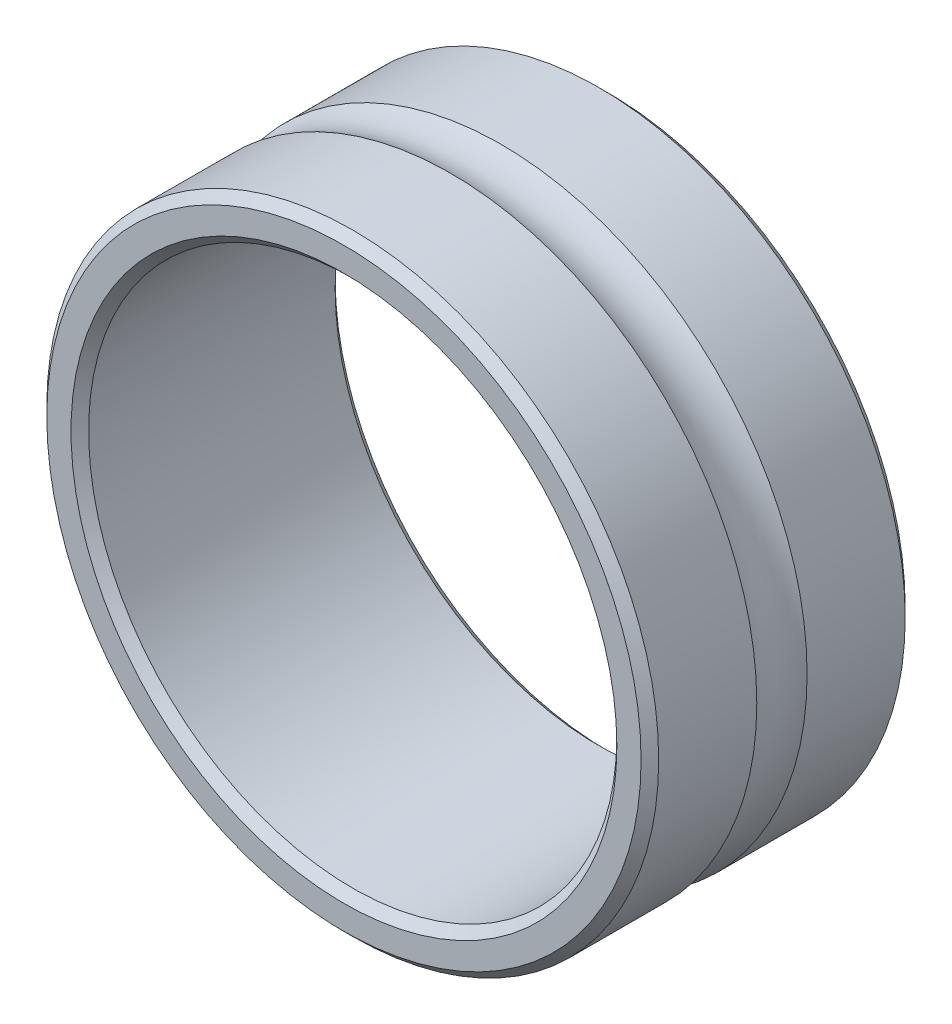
ISO-10303-21;
HEADER;
FILE_DESCRIPTION(('STEP AP214'),'2;1');
FILE_NAME('part.step','',(''),(''),'','','');
FILE_SCHEMA(('AUTOMOTIVE_DESIGN { 1 0 10303 214 1 1 1 1 }'));
ENDSEC;
DATA;
#1=APPLICATION_CONTEXT('core data for automotive mechanical design processes');
#2=APPLICATION_PROTOCOL_DEFINITION('international standard','automotive_design',2000,#1);
#3=PRODUCT_CONTEXT('',#1,'mechanical');
#4=PRODUCT('Part','Part','',(#3));
#5=PRODUCT_RELATED_PRODUCT_CATEGORY('part','',(#4));
#6=PRODUCT_DEFINITION_FORMATION('','',#4);
#7=PRODUCT_DEFINITION_CONTEXT('part definition',#1,'design');
#8=PRODUCT_DEFINITION('design','',#6,#7);
#9=PRODUCT_DEFINITION_SHAPE('','',#8);
#10=(LENGTH_UNIT() NAMED_UNIT(*) SI_UNIT(.MILLI.,.METRE.));
#11=(NAMED_UNIT(*) PLANE_ANGLE_UNIT() SI_UNIT($,.RADIAN.));
#12=(NAMED_UNIT(*) SI_UNIT($,.STERADIAN.) SOLID_ANGLE_UNIT());
#13=UNCERTAINTY_MEASURE_WITH_UNIT(LENGTH_MEASURE(1.E-05),#10,'distance_accuracy_value','');
#14=(GEOMETRIC_REPRESENTATION_CONTEXT(3) GLOBAL_UNCERTAINTY_ASSIGNED_CONTEXT((#13)) GLOBAL_UNIT_ASSIGNED_CONTEXT((#10,
#11,#12)) REPRESENTATION_CONTEXT('',''));
#15=CARTESIAN_POINT('',(0.,0.,0.));
#16=DIRECTION('',(0.,0.,1.));
#17=DIRECTION('',(1.,0.,0.));
#18=AXIS2_PLACEMENT_3D('',#15,#16,#17);
#19=CARTESIAN_POINT('',(0.,0.,0.));
#20=DIRECTION('',(0.,0.,1.));
#21=DIRECTION('',(1.,0.,0.));
#22=AXIS2_PLACEMENT_3D('',#19,#20,#21);
#23=TOROIDAL_SURFACE('',#22,3.9975,0.5955);
#24=CARTESIAN_POINT('',(0.,0.,0.285681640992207));
#25=DIRECTION('',(0.,0.,1.));
#26=DIRECTION('',(1.,0.,0.));
#27=AXIS2_PLACEMENT_3D('',#24,#25,#26);
#28=CIRCLE('',#27,3.475);
#29=CARTESIAN_POINT('',(3.475,0.,0.285681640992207));
#30=VERTEX_POINT('',#29);
#31=EDGE_CURVE('E42',#30,#30,#28,.T.);
#32=ORIENTED_EDGE('',*,*,#31,.F.);
#33=EDGE_LOOP('',(#32));
#34=FACE_BOUND('',#33,.T.);
#35=CARTESIAN_POINT('',(0.,0.,-0.285681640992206));
#36=DIRECTION('',(0.,0.,1.));
#37=DIRECTION('',(1.,0.,0.));
#38=AXIS2_PLACEMENT_3D('',#35,#36,#37);
#39=CIRCLE('',#38,3.475);
#40=CARTESIAN_POINT('',(3.475,0.,-0.285681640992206));
#41=VERTEX_POINT('',#40);
#42=EDGE_CURVE('E39',#41,#41,#39,.F.);
#43=ORIENTED_EDGE('',*,*,#42,.F.);
#44=EDGE_LOOP('',(#43));
#45=FACE_BOUND('',#44,.T.);
#46=ADVANCED_FACE('F15',(#34,#45),#23,.F.);
#47=CARTESIAN_POINT('',(0.,0.,0.));
#48=DIRECTION('',(0.,0.,1.));
#49=DIRECTION('',(1.,0.,0.));
#50=AXIS2_PLACEMENT_3D('',#47,#48,#49);
#51=CYLINDRICAL_SURFACE('',#50,3.475);
#52=ORIENTED_EDGE('',*,*,#31,.T.);
#53=EDGE_LOOP('',(#52));
#54=FACE_BOUND('',#53,.T.);
#55=CARTESIAN_POINT('',(0.,0.,1.40000000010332));
#56=DIRECTION('',(0.,0.,-1.));
#57=DIRECTION('',(-1.,0.,0.));
#58=AXIS2_PLACEMENT_3D('',#55,#56,#57);
#59=CIRCLE('',#58,3.4750000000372);
#60=CARTESIAN_POINT('',(-3.4750000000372,0.,1.40000000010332));
#61=VERTEX_POINT('',#60);
#62=EDGE_CURVE('E36',#61,#61,#59,.F.);
#63=ORIENTED_EDGE('',*,*,#62,.F.);
#64=EDGE_LOOP('',(#63));
#65=FACE_BOUND('',#64,.T.);
#66=ADVANCED_FACE('F112',(#54,#65),#51,.T.);
#67=CARTESIAN_POINT('',(0.,0.,0.));
#68=DIRECTION('',(0.,0.,1.));
#69=DIRECTION('',(1.,0.,0.));
#70=AXIS2_PLACEMENT_3D('',#67,#68,#69);
#71=CYLINDRICAL_SURFACE('',#70,3.475);
#72=CARTESIAN_POINT('',(0.,0.,-1.39999999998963));
#73=DIRECTION('',(0.,0.,1.));
#74=DIRECTION('',(1.,0.,0.));
#75=AXIS2_PLACEMENT_3D('',#72,#73,#74);
#76=CIRCLE('',#75,3.47499999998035);
#77=CARTESIAN_POINT('',(3.47499999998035,0.,-1.39999999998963));
#78=VERTEX_POINT('',#77);
#79=EDGE_CURVE('E33',#78,#78,#76,.F.);
#80=ORIENTED_EDGE('',*,*,#79,.F.);
#81=EDGE_LOOP('',(#80));
#82=FACE_BOUND('',#81,.T.);
#83=ORIENTED_EDGE('',*,*,#42,.T.);
#84=EDGE_LOOP('',(#83));
#85=FACE_BOUND('',#84,.T.);
#86=ADVANCED_FACE('F105',(#82,#85),#71,.T.);
#87=CARTESIAN_POINT('',(0.,0.,1.40000000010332));
#88=DIRECTION('',(0.,0.,-1.));
#89=DIRECTION('',(-1.,0.,0.));
#90=AXIS2_PLACEMENT_3D('',#87,#88,#89);
#91=CONICAL_SURFACE('',#90,3.4750000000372,0.785398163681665);
#92=CARTESIAN_POINT('',(0.,0.,1.50000000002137));
#93=DIRECTION('',(0.,0.,-1.));
#94=DIRECTION('',(-1.,0.,0.));
#95=AXIS2_PLACEMENT_3D('',#92,#93,#94);
#96=CIRCLE('',#95,3.3750000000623);
#97=CARTESIAN_POINT('',(-3.3750000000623,0.,1.50000000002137));
#98=VERTEX_POINT('',#97);
#99=EDGE_CURVE('E19',#98,#98,#96,.T.);
#100=ORIENTED_EDGE('',*,*,#99,.T.);
#101=EDGE_LOOP('',(#100));
#102=FACE_BOUND('',#101,.T.);
#103=ORIENTED_EDGE('',*,*,#62,.T.);
#104=EDGE_LOOP('',(#103));
#105=FACE_BOUND('',#104,.T.);
#106=ADVANCED_FACE('F56',(#102,#105),#91,.T.);
#107=CARTESIAN_POINT('',(0.,0.,-1.40000000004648));
#108=DIRECTION('',(0.,0.,1.));
#109=DIRECTION('',(1.,0.,0.));
#110=AXIS2_PLACEMENT_3D('',#107,#108,#109);
#111=CONICAL_SURFACE('',#110,3.47499999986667,0.785398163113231);
#112=CARTESIAN_POINT('',(0.,0.,-1.49999999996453));
#113=DIRECTION('',(0.,0.,1.));
#114=DIRECTION('',(1.,0.,0.));
#115=AXIS2_PLACEMENT_3D('',#112,#113,#114);
#116=CIRCLE('',#115,3.37500000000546);
#117=CARTESIAN_POINT('',(3.37500000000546,0.,-1.49999999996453));
#118=VERTEX_POINT('',#117);
#119=EDGE_CURVE('E49',#118,#118,#116,.T.);
#120=ORIENTED_EDGE('',*,*,#119,.T.);
#121=EDGE_LOOP('',(#120));
#122=FACE_BOUND('',#121,.T.);
#123=ORIENTED_EDGE('',*,*,#79,.T.);
#124=EDGE_LOOP('',(#123));
#125=FACE_BOUND('',#124,.T.);
#126=ADVANCED_FACE('F63',(#122,#125),#111,.T.);
#127=CARTESIAN_POINT('',(0.,3.475,1.5));
#128=DIRECTION('',(0.,0.,-1.));
#129=DIRECTION('',(-1.,0.,0.));
#130=AXIS2_PLACEMENT_3D('',#127,#128,#129);
#131=PLANE('',#130);
#132=ORIENTED_EDGE('',*,*,#99,.F.);
#133=EDGE_LOOP('',(#132));
#134=FACE_BOUND('',#133,.T.);
#135=CARTESIAN_POINT('',(0.,0.,1.50000000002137));
#136=DIRECTION('',(0.,0.,1.));
#137=DIRECTION('',(1.,0.,0.));
#138=AXIS2_PLACEMENT_3D('',#135,#136,#137);
#139=CIRCLE('',#138,3.0999999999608);
#140=CARTESIAN_POINT('',(3.0999999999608,0.,1.50000000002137));
#141=VERTEX_POINT('',#140);
#142=EDGE_CURVE('E47',#141,#141,#139,.F.);
#143=ORIENTED_EDGE('',*,*,#142,.T.);
#144=EDGE_LOOP('',(#143));
#145=FACE_BOUND('',#144,.T.);
#146=ADVANCED_FACE('F59',(#134,#145),#131,.F.);
#147=CARTESIAN_POINT('',(0.,3.475,-1.5));
#148=DIRECTION('',(0.,0.,1.));
#149=DIRECTION('',(1.,0.,0.));
#150=AXIS2_PLACEMENT_3D('',#147,#148,#149);
#151=PLANE('',#150);
#152=ORIENTED_EDGE('',*,*,#119,.F.);
#153=EDGE_LOOP('',(#152));
#154=FACE_BOUND('',#153,.T.);
#155=CARTESIAN_POINT('',(0.,0.,-1.49999999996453));
#156=DIRECTION('',(0.,0.,-1.));
#157=DIRECTION('',(-1.,0.,0.));
#158=AXIS2_PLACEMENT_3D('',#155,#156,#157);
#159=CIRCLE('',#158,3.0999999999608);
#160=CARTESIAN_POINT('',(-3.0999999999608,0.,-1.49999999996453));
#161=VERTEX_POINT('',#160);
#162=EDGE_CURVE('E28',#161,#161,#159,.F.);
#163=ORIENTED_EDGE('',*,*,#162,.T.);
#164=EDGE_LOOP('',(#163));
#165=FACE_BOUND('',#164,.T.);
#166=ADVANCED_FACE('F62',(#154,#165),#151,.F.);
#167=CARTESIAN_POINT('',(0.,0.,1.50000000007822));
#168=DIRECTION('',(0.,0.,1.));
#169=DIRECTION('',(1.,0.,0.));
#170=AXIS2_PLACEMENT_3D('',#167,#168,#169);
#171=CONICAL_SURFACE('',#170,3.10000000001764,0.785398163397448);
#172=CARTESIAN_POINT('',(0.,0.,1.4));
#173=DIRECTION('',(0.,0.,1.));
#174=DIRECTION('',(1.,0.,0.));
#175=AXIS2_PLACEMENT_3D('',#172,#173,#174);
#176=CIRCLE('',#175,3.);
#177=CARTESIAN_POINT('',(3.,0.,1.4));
#178=VERTEX_POINT('',#177);
#179=EDGE_CURVE('E23',#178,#178,#176,.F.);
#180=ORIENTED_EDGE('',*,*,#179,.T.);
#181=EDGE_LOOP('',(#180));
#182=FACE_BOUND('',#181,.T.);
#183=ORIENTED_EDGE('',*,*,#142,.F.);
#184=EDGE_LOOP('',(#183));
#185=FACE_BOUND('',#184,.T.);
#186=ADVANCED_FACE('F67',(#182,#185),#171,.F.);
#187=CARTESIAN_POINT('',(0.,0.,-1.49999999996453));
#188=DIRECTION('',(0.,0.,-1.));
#189=DIRECTION('',(-1.,0.,0.));
#190=AXIS2_PLACEMENT_3D('',#187,#188,#189);
#191=CONICAL_SURFACE('',#190,3.0999999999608,0.785398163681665);
#192=CARTESIAN_POINT('',(0.,0.,-1.4));
#193=DIRECTION('',(0.,0.,1.));
#194=DIRECTION('',(1.,0.,0.));
#195=AXIS2_PLACEMENT_3D('',#192,#193,#194);
#196=CIRCLE('',#195,3.);
#197=CARTESIAN_POINT('',(3.,0.,-1.4));
#198=VERTEX_POINT('',#197);
#199=EDGE_CURVE('E10',#198,#198,#196,.T.);
#200=ORIENTED_EDGE('',*,*,#199,.T.);
#201=EDGE_LOOP('',(#200));
#202=FACE_BOUND('',#201,.T.);
#203=ORIENTED_EDGE('',*,*,#162,.F.);
#204=EDGE_LOOP('',(#203));
#205=FACE_BOUND('',#204,.T.);
#206=ADVANCED_FACE('F69',(#202,#205),#191,.F.);
#207=CARTESIAN_POINT('',(0.,0.,0.));
#208=DIRECTION('',(0.,0.,1.));
#209=DIRECTION('',(1.,0.,0.));
#210=AXIS2_PLACEMENT_3D('',#207,#208,#209);
#211=CYLINDRICAL_SURFACE('',#210,3.);
#212=ORIENTED_EDGE('',*,*,#199,.F.);
#213=EDGE_LOOP('',(#212));
#214=FACE_BOUND('',#213,.T.);
#215=ORIENTED_EDGE('',*,*,#179,.F.);
#216=EDGE_LOOP('',(#215));
#217=FACE_BOUND('',#216,.T.);
#218=ADVANCED_FACE('F17',(#214,#217),#211,.F.);
#219=CLOSED_SHELL('',(#46,#66,#86,#106,#126,#146,#166,#186,#206,#218));
#220=MANIFOLD_SOLID_BREP('B1',#219);
#221=ADVANCED_BREP_SHAPE_REPRESENTATION('',(#18,#220),#14);
#222=SHAPE_DEFINITION_REPRESENTATION(#9,#221);
ENDSEC;
END-ISO-10303-21;
